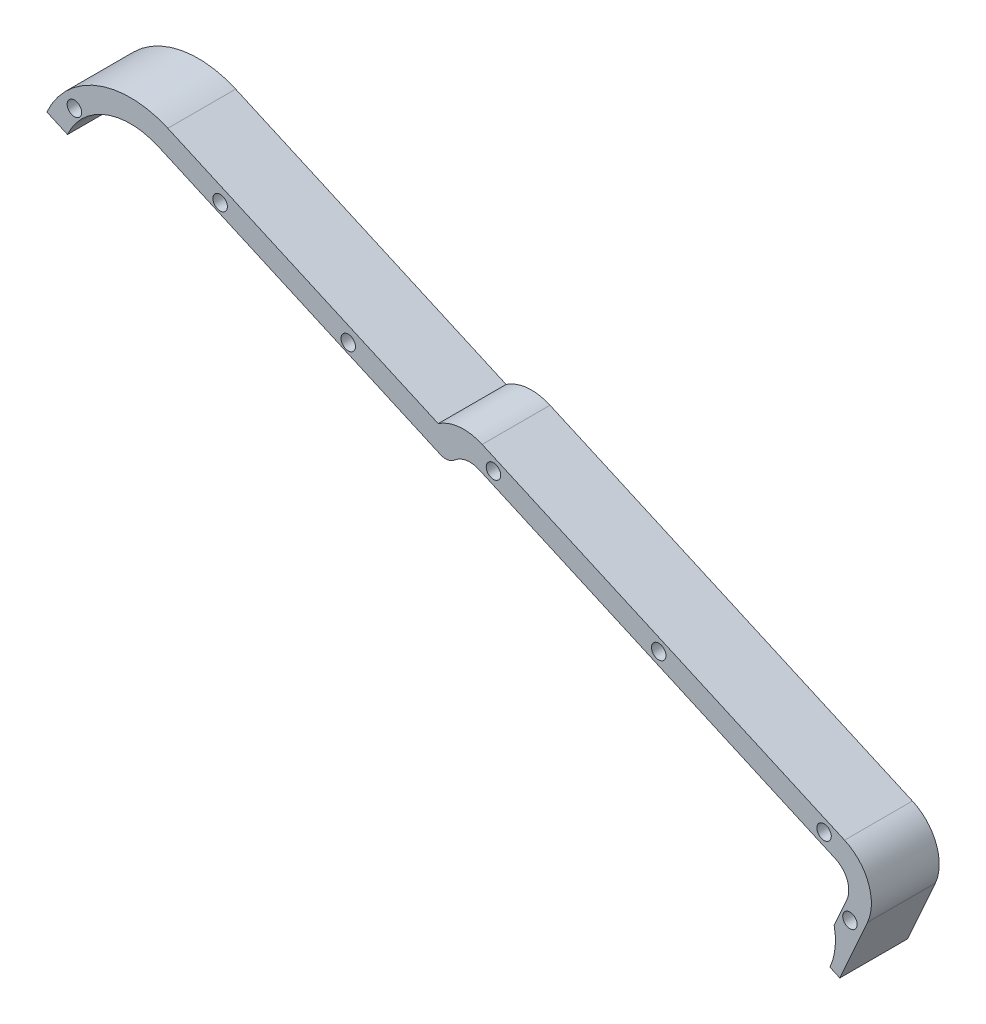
from build123d import *

# Parameters (mm, degrees)
SKETCH1_R           = 1.6
BOSS_EXTRUDE1_DEPTH = 15


with BuildPart() as part:
    # Sketch1 → Boss-Extrude1 (new body)
    with BuildSketch(Plane.XY.offset(15)):
        with BuildLine():
            Line((-72.22002218, 79.667962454), (-75.011801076, 73.405193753))
            ThreePointArc((-75.011801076, 73.405193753), (-74.811765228, 69.081915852), (-75.941706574, 64.904119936))
            Line((-75.941706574, 64.904119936), (-73.760503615, 63.931796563))
            Line((-73.760503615, 63.931796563), (-67.653220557, 77.632201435))
            ThreePointArc((-67.653220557, 77.632201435), (-67.449390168, 85.283155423), (-72.715301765, 90.837326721))
            Line((-72.715301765, 90.837326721), (-152.817002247, 126.544575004))
            ThreePointArc((-152.817002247, 126.544575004), (-157.784388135, 127.370762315), (-162.524605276, 125.671394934))
            Line((-162.524605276, 125.671394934), (-222.299360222, 152.317421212))
            ThreePointArc((-222.299360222, 152.317421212), (-237.792542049, 152.73017775), (-249.039738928, 142.066706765))
            Line((-249.039738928, 142.066706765), (-244.472937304, 140.030945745))
            ThreePointArc((-244.472937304, 140.030945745), (-236.002826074, 148.061460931), (-224.335121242, 147.750619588))
            Line((-224.335121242, 147.750619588), (-162.103514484, 120.00939287))
            ThreePointArc((-162.103514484, 120.00939287), (-160.41331337, 119.786320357), (-158.874492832, 120.520195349))
            ThreePointArc((-158.874492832, 120.520195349), (-156.309791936, 121.743320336), (-153.492790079, 121.371532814))
            Line((-153.492790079, 121.371532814), (-74.751062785, 86.270525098))
            ThreePointArc((-74.751062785, 86.270525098), (-72.118106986, 83.493439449), (-72.22002218, 79.667962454))
        make_face()
        with Locations((-113.784032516, 106.407550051)):
            Circle(SKETCH1_R, mode=Mode.SUBTRACT)
        with Locations((-150.318445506, 122.693638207)):
            Circle(SKETCH1_R, mode=Mode.SUBTRACT)
        with Locations((-77.249619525, 90.121461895)):
            Circle(SKETCH1_R, mode=Mode.SUBTRACT)
        with Locations((-71.52342211, 76.072861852)):
            Circle(SKETCH1_R, mode=Mode.SUBTRACT)
        with Locations((-210.733772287, 143.877209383)):
            Circle(SKETCH1_R, mode=Mode.SUBTRACT)
        with Locations((-182.419602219, 131.255491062)):
            Circle(SKETCH1_R, mode=Mode.SUBTRACT)
        with Locations((-242.947351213, 145.810375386)):
            Circle(SKETCH1_R, mode=Mode.SUBTRACT)
    extrude(amount=-BOSS_EXTRUDE1_DEPTH)


solid = part.part
